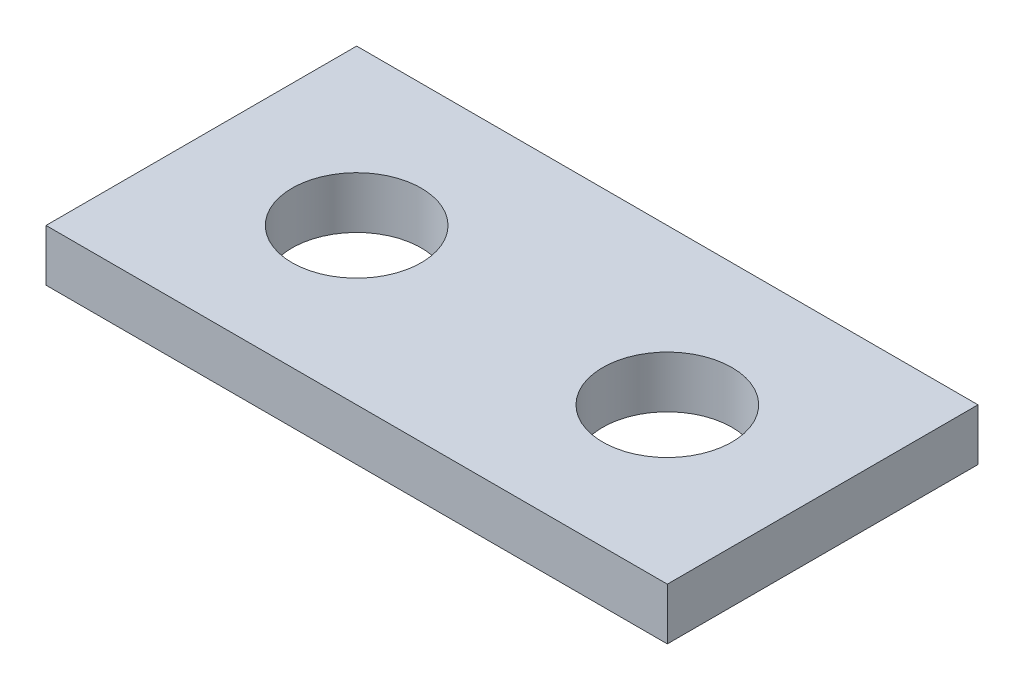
ISO-10303-21;
HEADER;
FILE_DESCRIPTION(('STEP AP214'),'2;1');
FILE_NAME('part.step','',(''),(''),'','','');
FILE_SCHEMA(('AUTOMOTIVE_DESIGN { 1 0 10303 214 1 1 1 1 }'));
ENDSEC;
DATA;
#1=APPLICATION_CONTEXT('core data for automotive mechanical design processes');
#2=APPLICATION_PROTOCOL_DEFINITION('international standard','automotive_design',2000,#1);
#3=PRODUCT_CONTEXT('',#1,'mechanical');
#4=PRODUCT('Part','Part','',(#3));
#5=PRODUCT_RELATED_PRODUCT_CATEGORY('part','',(#4));
#6=PRODUCT_DEFINITION_FORMATION('','',#4);
#7=PRODUCT_DEFINITION_CONTEXT('part definition',#1,'design');
#8=PRODUCT_DEFINITION('design','',#6,#7);
#9=PRODUCT_DEFINITION_SHAPE('','',#8);
#10=(LENGTH_UNIT() NAMED_UNIT(*) SI_UNIT(.MILLI.,.METRE.));
#11=(NAMED_UNIT(*) PLANE_ANGLE_UNIT() SI_UNIT($,.RADIAN.));
#12=(NAMED_UNIT(*) SI_UNIT($,.STERADIAN.) SOLID_ANGLE_UNIT());
#13=UNCERTAINTY_MEASURE_WITH_UNIT(LENGTH_MEASURE(1.E-05),#10,'distance_accuracy_value','');
#14=(GEOMETRIC_REPRESENTATION_CONTEXT(3) GLOBAL_UNCERTAINTY_ASSIGNED_CONTEXT((#13)) GLOBAL_UNIT_ASSIGNED_CONTEXT((#10,
#11,#12)) REPRESENTATION_CONTEXT('',''));
#15=CARTESIAN_POINT('',(0.,0.,0.));
#16=DIRECTION('',(0.,0.,1.));
#17=DIRECTION('',(1.,0.,0.));
#18=AXIS2_PLACEMENT_3D('',#15,#16,#17);
#19=CARTESIAN_POINT('',(0.,1.5875,0.));
#20=DIRECTION('',(0.,-1.,0.));
#21=DIRECTION('',(0.,0.,-1.));
#22=AXIS2_PLACEMENT_3D('',#19,#20,#21);
#23=PLANE('',#22);
#24=CARTESIAN_POINT('',(-4.7625,1.5875,0.));
#25=DIRECTION('',(0.,1.,0.));
#26=DIRECTION('',(0.,0.,1.));
#27=AXIS2_PLACEMENT_3D('',#24,#25,#26);
#28=CIRCLE('',#27,1.9812);
#29=CARTESIAN_POINT('',(-4.7625,1.5875,1.9812));
#30=VERTEX_POINT('',#29);
#31=EDGE_CURVE('E102',#30,#30,#28,.T.);
#32=ORIENTED_EDGE('',*,*,#31,.F.);
#33=EDGE_LOOP('',(#32));
#34=FACE_BOUND('',#33,.T.);
#35=DIRECTION('',(0.,0.,-1.));
#36=VECTOR('',#35,1.);
#37=CARTESIAN_POINT('',(9.525,1.5875,4.7625));
#38=LINE('',#37,#36);
#39=CARTESIAN_POINT('',(9.525,1.5875,4.7625));
#40=VERTEX_POINT('',#39);
#41=CARTESIAN_POINT('',(9.525,1.5875,-4.7625));
#42=VERTEX_POINT('',#41);
#43=EDGE_CURVE('E87',#40,#42,#38,.T.);
#44=ORIENTED_EDGE('',*,*,#43,.T.);
#45=DIRECTION('',(-1.,0.,0.));
#46=VECTOR('',#45,1.);
#47=CARTESIAN_POINT('',(-9.525,1.5875,-4.7625));
#48=LINE('',#47,#46);
#49=CARTESIAN_POINT('',(-9.525,1.5875,-4.7625));
#50=VERTEX_POINT('',#49);
#51=EDGE_CURVE('E82',#42,#50,#48,.T.);
#52=ORIENTED_EDGE('',*,*,#51,.T.);
#53=DIRECTION('',(0.,0.,1.));
#54=VECTOR('',#53,1.);
#55=CARTESIAN_POINT('',(-9.525,1.5875,4.7625));
#56=LINE('',#55,#54);
#57=CARTESIAN_POINT('',(-9.525,1.5875,4.7625));
#58=VERTEX_POINT('',#57);
#59=EDGE_CURVE('E85',#50,#58,#56,.T.);
#60=ORIENTED_EDGE('',*,*,#59,.T.);
#61=DIRECTION('',(1.,0.,0.));
#62=VECTOR('',#61,1.);
#63=CARTESIAN_POINT('',(-9.525,1.5875,4.7625));
#64=LINE('',#63,#62);
#65=EDGE_CURVE('E52',#58,#40,#64,.T.);
#66=ORIENTED_EDGE('',*,*,#65,.T.);
#67=EDGE_LOOP('',(#44,#52,#60,#66));
#68=FACE_BOUND('',#67,.T.);
#69=CARTESIAN_POINT('',(4.7625,1.5875,0.));
#70=DIRECTION('',(0.,1.,0.));
#71=DIRECTION('',(0.,0.,-1.));
#72=AXIS2_PLACEMENT_3D('',#69,#70,#71);
#73=CIRCLE('',#72,1.9812);
#74=CARTESIAN_POINT('',(4.7625,1.5875,-1.9812));
#75=VERTEX_POINT('',#74);
#76=EDGE_CURVE('E117',#75,#75,#73,.T.);
#77=ORIENTED_EDGE('',*,*,#76,.F.);
#78=EDGE_LOOP('',(#77));
#79=FACE_BOUND('',#78,.T.);
#80=ADVANCED_FACE('F35',(#34,#68,#79),#23,.F.);
#81=CARTESIAN_POINT('',(0.,0.,0.));
#82=DIRECTION('',(0.,-1.,0.));
#83=DIRECTION('',(0.,0.,-1.));
#84=AXIS2_PLACEMENT_3D('',#81,#82,#83);
#85=PLANE('',#84);
#86=CARTESIAN_POINT('',(-4.7625,0.,0.));
#87=DIRECTION('',(0.,1.,0.));
#88=DIRECTION('',(0.,0.,1.));
#89=AXIS2_PLACEMENT_3D('',#86,#87,#88);
#90=CIRCLE('',#89,1.9812);
#91=CARTESIAN_POINT('',(-4.7625,0.,1.9812));
#92=VERTEX_POINT('',#91);
#93=EDGE_CURVE('E114',#92,#92,#90,.T.);
#94=ORIENTED_EDGE('',*,*,#93,.T.);
#95=EDGE_LOOP('',(#94));
#96=FACE_BOUND('',#95,.T.);
#97=DIRECTION('',(0.,0.,-1.));
#98=VECTOR('',#97,1.);
#99=CARTESIAN_POINT('',(9.525,0.,4.7625));
#100=LINE('',#99,#98);
#101=CARTESIAN_POINT('',(9.525,0.,4.7625));
#102=VERTEX_POINT('',#101);
#103=CARTESIAN_POINT('',(9.525,0.,-4.7625));
#104=VERTEX_POINT('',#103);
#105=EDGE_CURVE('E99',#102,#104,#100,.T.);
#106=ORIENTED_EDGE('',*,*,#105,.F.);
#107=DIRECTION('',(1.,0.,0.));
#108=VECTOR('',#107,1.);
#109=CARTESIAN_POINT('',(-9.525,0.,4.7625));
#110=LINE('',#109,#108);
#111=CARTESIAN_POINT('',(-9.525,0.,4.7625));
#112=VERTEX_POINT('',#111);
#113=EDGE_CURVE('E75',#112,#102,#110,.T.);
#114=ORIENTED_EDGE('',*,*,#113,.F.);
#115=DIRECTION('',(0.,0.,1.));
#116=VECTOR('',#115,1.);
#117=CARTESIAN_POINT('',(-9.525,0.,4.7625));
#118=LINE('',#117,#116);
#119=CARTESIAN_POINT('',(-9.525,0.,-4.7625));
#120=VERTEX_POINT('',#119);
#121=EDGE_CURVE('E69',#120,#112,#118,.T.);
#122=ORIENTED_EDGE('',*,*,#121,.F.);
#123=DIRECTION('',(-1.,0.,0.));
#124=VECTOR('',#123,1.);
#125=CARTESIAN_POINT('',(-9.525,0.,-4.7625));
#126=LINE('',#125,#124);
#127=EDGE_CURVE('E91',#104,#120,#126,.T.);
#128=ORIENTED_EDGE('',*,*,#127,.F.);
#129=EDGE_LOOP('',(#106,#114,#122,#128));
#130=FACE_BOUND('',#129,.T.);
#131=CARTESIAN_POINT('',(4.7625,0.,0.));
#132=DIRECTION('',(0.,1.,0.));
#133=DIRECTION('',(0.,0.,-1.));
#134=AXIS2_PLACEMENT_3D('',#131,#132,#133);
#135=CIRCLE('',#134,1.9812);
#136=CARTESIAN_POINT('',(4.7625,0.,-1.9812));
#137=VERTEX_POINT('',#136);
#138=EDGE_CURVE('E120',#137,#137,#135,.T.);
#139=ORIENTED_EDGE('',*,*,#138,.T.);
#140=EDGE_LOOP('',(#139));
#141=FACE_BOUND('',#140,.T.);
#142=ADVANCED_FACE('F110',(#96,#130,#141),#85,.T.);
#143=CARTESIAN_POINT('',(9.525,1.5875,4.7625));
#144=DIRECTION('',(-1.,0.,0.));
#145=DIRECTION('',(0.,0.,1.));
#146=AXIS2_PLACEMENT_3D('',#143,#144,#145);
#147=PLANE('',#146);
#148=ORIENTED_EDGE('',*,*,#105,.T.);
#149=DIRECTION('',(0.,-1.,0.));
#150=VECTOR('',#149,1.);
#151=CARTESIAN_POINT('',(9.525,1.5875,-4.7625));
#152=LINE('',#151,#150);
#153=EDGE_CURVE('E11',#42,#104,#152,.T.);
#154=ORIENTED_EDGE('',*,*,#153,.F.);
#155=ORIENTED_EDGE('',*,*,#43,.F.);
#156=DIRECTION('',(0.,-1.,0.));
#157=VECTOR('',#156,1.);
#158=CARTESIAN_POINT('',(9.525,1.5875,4.7625));
#159=LINE('',#158,#157);
#160=EDGE_CURVE('E95',#40,#102,#159,.T.);
#161=ORIENTED_EDGE('',*,*,#160,.T.);
#162=EDGE_LOOP('',(#148,#154,#155,#161));
#163=FACE_BOUND('',#162,.T.);
#164=ADVANCED_FACE('F37',(#163),#147,.F.);
#165=CARTESIAN_POINT('',(-9.525,1.5875,-4.7625));
#166=DIRECTION('',(0.,0.,1.));
#167=DIRECTION('',(1.,0.,0.));
#168=AXIS2_PLACEMENT_3D('',#165,#166,#167);
#169=PLANE('',#168);
#170=ORIENTED_EDGE('',*,*,#127,.T.);
#171=DIRECTION('',(0.,-1.,0.));
#172=VECTOR('',#171,1.);
#173=CARTESIAN_POINT('',(-9.525,1.5875,-4.7625));
#174=LINE('',#173,#172);
#175=EDGE_CURVE('E44',#50,#120,#174,.T.);
#176=ORIENTED_EDGE('',*,*,#175,.F.);
#177=ORIENTED_EDGE('',*,*,#51,.F.);
#178=ORIENTED_EDGE('',*,*,#153,.T.);
#179=EDGE_LOOP('',(#170,#176,#177,#178));
#180=FACE_BOUND('',#179,.T.);
#181=ADVANCED_FACE('F90',(#180),#169,.F.);
#182=CARTESIAN_POINT('',(-9.525,1.5875,4.7625));
#183=DIRECTION('',(1.,0.,0.));
#184=DIRECTION('',(0.,0.,-1.));
#185=AXIS2_PLACEMENT_3D('',#182,#183,#184);
#186=PLANE('',#185);
#187=ORIENTED_EDGE('',*,*,#121,.T.);
#188=DIRECTION('',(0.,-1.,0.));
#189=VECTOR('',#188,1.);
#190=CARTESIAN_POINT('',(-9.525,1.5875,4.7625));
#191=LINE('',#190,#189);
#192=EDGE_CURVE('E92',#58,#112,#191,.T.);
#193=ORIENTED_EDGE('',*,*,#192,.F.);
#194=ORIENTED_EDGE('',*,*,#59,.F.);
#195=ORIENTED_EDGE('',*,*,#175,.T.);
#196=EDGE_LOOP('',(#187,#193,#194,#195));
#197=FACE_BOUND('',#196,.T.);
#198=ADVANCED_FACE('F93',(#197),#186,.F.);
#199=CARTESIAN_POINT('',(-9.525,1.5875,4.7625));
#200=DIRECTION('',(0.,0.,-1.));
#201=DIRECTION('',(-1.,0.,0.));
#202=AXIS2_PLACEMENT_3D('',#199,#200,#201);
#203=PLANE('',#202);
#204=ORIENTED_EDGE('',*,*,#113,.T.);
#205=ORIENTED_EDGE('',*,*,#160,.F.);
#206=ORIENTED_EDGE('',*,*,#65,.F.);
#207=ORIENTED_EDGE('',*,*,#192,.T.);
#208=EDGE_LOOP('',(#204,#205,#206,#207));
#209=FACE_BOUND('',#208,.T.);
#210=ADVANCED_FACE('F107',(#209),#203,.F.);
#211=CARTESIAN_POINT('',(-4.7625,1.5875,0.));
#212=DIRECTION('',(0.,-1.,0.));
#213=DIRECTION('',(0.,0.,-1.));
#214=AXIS2_PLACEMENT_3D('',#211,#212,#213);
#215=CYLINDRICAL_SURFACE('',#214,1.9812);
#216=ORIENTED_EDGE('',*,*,#31,.T.);
#217=EDGE_LOOP('',(#216));
#218=FACE_BOUND('',#217,.T.);
#219=ORIENTED_EDGE('',*,*,#93,.F.);
#220=EDGE_LOOP('',(#219));
#221=FACE_BOUND('',#220,.T.);
#222=ADVANCED_FACE('F138',(#218,#221),#215,.F.);
#223=CARTESIAN_POINT('',(4.7625,1.5875,0.));
#224=DIRECTION('',(0.,-1.,0.));
#225=DIRECTION('',(0.,0.,-1.));
#226=AXIS2_PLACEMENT_3D('',#223,#224,#225);
#227=CYLINDRICAL_SURFACE('',#226,1.9812);
#228=ORIENTED_EDGE('',*,*,#76,.T.);
#229=EDGE_LOOP('',(#228));
#230=FACE_BOUND('',#229,.T.);
#231=ORIENTED_EDGE('',*,*,#138,.F.);
#232=EDGE_LOOP('',(#231));
#233=FACE_BOUND('',#232,.T.);
#234=ADVANCED_FACE('F126',(#230,#233),#227,.F.);
#235=CLOSED_SHELL('',(#80,#142,#164,#181,#198,#210,#222,#234));
#236=MANIFOLD_SOLID_BREP('B2',#235);
#237=ADVANCED_BREP_SHAPE_REPRESENTATION('',(#18,#236),#14);
#238=SHAPE_DEFINITION_REPRESENTATION(#9,#237);
ENDSEC;
END-ISO-10303-21;
